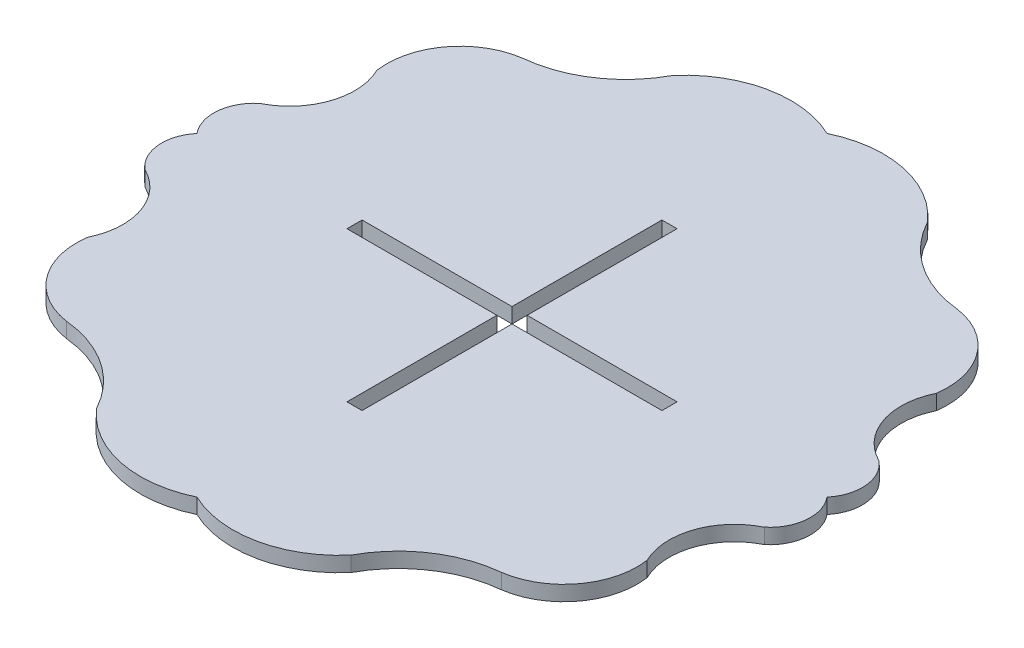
from build123d import *

# Parameters (mm, degrees)
BOSS_EXTRUDE1_DEPTH = 12


with BuildPart() as part:
    # Sketch1 → Boss-Extrude1 (new body)
    with BuildSketch(Plane(origin=(0, 0, 0), x_dir=(1, 0, 0), z_dir=(0, 1, 0))):
        with BuildLine():
            ThreePointArc((0, 250), (-54.132903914, 256.514273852), (-101.017560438, 228.681989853))
            ThreePointArc((-101.017560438, 228.681989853), (-130.802941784, 195.842475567), (-172.54685275, 180.907665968))
            ThreePointArc((-172.54685275, 180.907665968), (-210.974348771, 158.140183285), (-222.047650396, 114.868798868))
            ThreePointArc((-222.047650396, 114.868798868), (-219.570387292, 75.26469853), (-245.823025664, 45.508681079))
            ThreePointArc((-245.823025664, 45.508681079), (-257.336669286, 23.619420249), (-250, 0))
            ThreePointArc((-250, 0), (-257.336669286, -23.619420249), (-245.823025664, -45.508681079))
            ThreePointArc((-245.823025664, -45.508681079), (-219.570387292, -75.26469853), (-222.047650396, -114.868798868))
            ThreePointArc((-222.047650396, -114.868798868), (-210.974348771, -158.140183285), (-172.54685275, -180.907665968))
            ThreePointArc((-172.54685275, -180.907665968), (-130.802941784, -195.842475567), (-101.017560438, -228.681989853))
            ThreePointArc((-101.017560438, -228.681989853), (-54.132903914, -256.514273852), (0, -250))
            ThreePointArc((0, -250), (54.132903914, -256.514273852), (101.017560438, -228.681989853))
            ThreePointArc((101.017560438, -228.681989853), (130.802941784, -195.842475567), (172.54685275, -180.907665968))
            ThreePointArc((172.54685275, -180.907665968), (210.974348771, -158.140183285), (222.047650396, -114.868798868))
            ThreePointArc((222.047650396, -114.868798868), (219.570387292, -75.26469853), (245.823025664, -45.508681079))
            ThreePointArc((245.823025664, -45.508681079), (257.336669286, -23.619420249), (250, 0))
            ThreePointArc((250, 0), (257.336669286, 23.619420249), (245.823025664, 45.508681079))
            ThreePointArc((245.823025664, 45.508681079), (219.570387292, 75.26469853), (222.047650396, 114.868798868))
            ThreePointArc((222.047650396, 114.868798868), (210.974348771, 158.140183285), (172.54685275, 180.907665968))
            ThreePointArc((172.54685275, 180.907665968), (130.802941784, 195.842475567), (101.017560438, 228.681989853))
            ThreePointArc((101.017560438, 228.681989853), (54.132903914, 256.514273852), (0, 250))
        make_face()
        Polygon((6, 6), (125, 6), (125, -6), (6, -6), (6, -125), (-6, -125), (-6, -6), (-125, -6), (-125, 6), (-6, 6), (-6, 125), (6, 125), align=None, mode=Mode.SUBTRACT)
    extrude(amount=BOSS_EXTRUDE1_DEPTH)


solid = part.part
